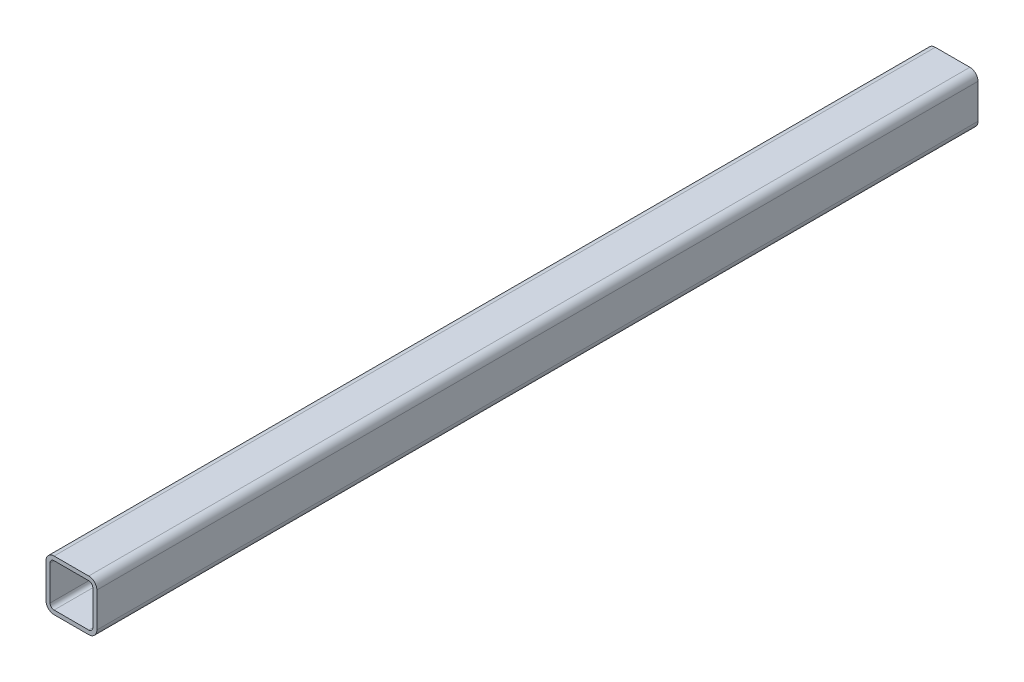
ISO-10303-21;
HEADER;
FILE_DESCRIPTION(('STEP AP214'),'2;1');
FILE_NAME('part.step','',(''),(''),'','','');
FILE_SCHEMA(('AUTOMOTIVE_DESIGN { 1 0 10303 214 1 1 1 1 }'));
ENDSEC;
DATA;
#1=APPLICATION_CONTEXT('core data for automotive mechanical design processes');
#2=APPLICATION_PROTOCOL_DEFINITION('international standard','automotive_design',2000,#1);
#3=PRODUCT_CONTEXT('',#1,'mechanical');
#4=PRODUCT('Part','Part','',(#3));
#5=PRODUCT_RELATED_PRODUCT_CATEGORY('part','',(#4));
#6=PRODUCT_DEFINITION_FORMATION('','',#4);
#7=PRODUCT_DEFINITION_CONTEXT('part definition',#1,'design');
#8=PRODUCT_DEFINITION('design','',#6,#7);
#9=PRODUCT_DEFINITION_SHAPE('','',#8);
#10=(LENGTH_UNIT() NAMED_UNIT(*) SI_UNIT(.MILLI.,.METRE.));
#11=(NAMED_UNIT(*) PLANE_ANGLE_UNIT() SI_UNIT($,.RADIAN.));
#12=(NAMED_UNIT(*) SI_UNIT($,.STERADIAN.) SOLID_ANGLE_UNIT());
#13=UNCERTAINTY_MEASURE_WITH_UNIT(LENGTH_MEASURE(1.E-05),#10,'distance_accuracy_value','');
#14=(GEOMETRIC_REPRESENTATION_CONTEXT(3) GLOBAL_UNCERTAINTY_ASSIGNED_CONTEXT((#13)) GLOBAL_UNIT_ASSIGNED_CONTEXT((#10,
#11,#12)) REPRESENTATION_CONTEXT('',''));
#15=CARTESIAN_POINT('',(0.,0.,0.));
#16=DIRECTION('',(0.,0.,1.));
#17=DIRECTION('',(1.,0.,0.));
#18=AXIS2_PLACEMENT_3D('',#15,#16,#17);
#19=CARTESIAN_POINT('',(-12.97432,12.97432,330.2));
#20=DIRECTION('',(0.,0.,1.));
#21=DIRECTION('',(1.,0.,0.));
#22=AXIS2_PLACEMENT_3D('',#19,#20,#21);
#23=PLANE('',#22);
#24=CARTESIAN_POINT('',(-12.97432,12.97432,330.2));
#25=DIRECTION('',(0.,0.,1.));
#26=DIRECTION('',(-1.,0.,0.));
#27=AXIS2_PLACEMENT_3D('',#24,#25,#26);
#28=CIRCLE('',#27,6.07568);
#29=CARTESIAN_POINT('',(-12.97432,19.05,330.2));
#30=VERTEX_POINT('',#29);
#31=CARTESIAN_POINT('',(-19.05,12.97432,330.2));
#32=VERTEX_POINT('',#31);
#33=EDGE_CURVE('E260',#30,#32,#28,.T.);
#34=ORIENTED_EDGE('',*,*,#33,.T.);
#35=DIRECTION('',(0.,-1.,0.));
#36=VECTOR('',#35,1.);
#37=CARTESIAN_POINT('',(-19.05,12.97432,330.2));
#38=LINE('',#37,#36);
#39=CARTESIAN_POINT('',(-19.05,-12.97432,330.2));
#40=VERTEX_POINT('',#39);
#41=EDGE_CURVE('E263',#32,#40,#38,.T.);
#42=ORIENTED_EDGE('',*,*,#41,.T.);
#43=CARTESIAN_POINT('',(-12.97432,-12.97432,330.2));
#44=DIRECTION('',(0.,0.,1.));
#45=DIRECTION('',(-1.,0.,0.));
#46=AXIS2_PLACEMENT_3D('',#43,#44,#45);
#47=CIRCLE('',#46,6.07568);
#48=CARTESIAN_POINT('',(-12.97432,-19.05,330.2));
#49=VERTEX_POINT('',#48);
#50=EDGE_CURVE('E266',#40,#49,#47,.T.);
#51=ORIENTED_EDGE('',*,*,#50,.T.);
#52=DIRECTION('',(1.,0.,0.));
#53=VECTOR('',#52,1.);
#54=CARTESIAN_POINT('',(-12.97432,-19.05,330.2));
#55=LINE('',#54,#53);
#56=CARTESIAN_POINT('',(12.97432,-19.05,330.2));
#57=VERTEX_POINT('',#56);
#58=EDGE_CURVE('E268',#49,#57,#55,.T.);
#59=ORIENTED_EDGE('',*,*,#58,.T.);
#60=CARTESIAN_POINT('',(12.97432,-12.97432,330.2));
#61=DIRECTION('',(0.,0.,1.));
#62=DIRECTION('',(1.,0.,0.));
#63=AXIS2_PLACEMENT_3D('',#60,#61,#62);
#64=CIRCLE('',#63,6.07568);
#65=CARTESIAN_POINT('',(19.05,-12.97432,330.2));
#66=VERTEX_POINT('',#65);
#67=EDGE_CURVE('E270',#57,#66,#64,.T.);
#68=ORIENTED_EDGE('',*,*,#67,.T.);
#69=DIRECTION('',(0.,1.,0.));
#70=VECTOR('',#69,1.);
#71=CARTESIAN_POINT('',(19.05,12.97432,330.2));
#72=LINE('',#71,#70);
#73=CARTESIAN_POINT('',(19.05,12.97432,330.2));
#74=VERTEX_POINT('',#73);
#75=EDGE_CURVE('E272',#66,#74,#72,.T.);
#76=ORIENTED_EDGE('',*,*,#75,.T.);
#77=CARTESIAN_POINT('',(12.97432,12.97432,330.2));
#78=DIRECTION('',(0.,0.,1.));
#79=DIRECTION('',(1.,0.,0.));
#80=AXIS2_PLACEMENT_3D('',#77,#78,#79);
#81=CIRCLE('',#80,6.07568);
#82=CARTESIAN_POINT('',(12.97432,19.05,330.2));
#83=VERTEX_POINT('',#82);
#84=EDGE_CURVE('E274',#74,#83,#81,.T.);
#85=ORIENTED_EDGE('',*,*,#84,.T.);
#86=DIRECTION('',(-1.,0.,0.));
#87=VECTOR('',#86,1.);
#88=CARTESIAN_POINT('',(-12.97432,19.05,330.2));
#89=LINE('',#88,#87);
#90=EDGE_CURVE('E276',#83,#30,#89,.T.);
#91=ORIENTED_EDGE('',*,*,#90,.T.);
#92=EDGE_LOOP('',(#34,#42,#51,#59,#68,#76,#85,#91));
#93=FACE_BOUND('',#92,.T.);
#94=DIRECTION('',(0.,-1.,0.));
#95=VECTOR('',#94,1.);
#96=CARTESIAN_POINT('',(-16.01216,12.97432,330.2));
#97=LINE('',#96,#95);
#98=CARTESIAN_POINT('',(-16.01216,12.97432,330.2));
#99=VERTEX_POINT('',#98);
#100=CARTESIAN_POINT('',(-16.01216,-12.97432,330.2));
#101=VERTEX_POINT('',#100);
#102=EDGE_CURVE('E203',#99,#101,#97,.T.);
#103=ORIENTED_EDGE('',*,*,#102,.F.);
#104=CARTESIAN_POINT('',(-12.97432,12.97432,330.2));
#105=DIRECTION('',(0.,0.,-1.));
#106=DIRECTION('',(-1.,0.,0.));
#107=AXIS2_PLACEMENT_3D('',#104,#105,#106);
#108=CIRCLE('',#107,3.03784);
#109=CARTESIAN_POINT('',(-12.97432,16.01216,330.2));
#110=VERTEX_POINT('',#109);
#111=EDGE_CURVE('E195',#110,#99,#108,.F.);
#112=ORIENTED_EDGE('',*,*,#111,.F.);
#113=DIRECTION('',(-1.,0.,0.));
#114=VECTOR('',#113,1.);
#115=CARTESIAN_POINT('',(-12.97432,16.01216,330.2));
#116=LINE('',#115,#114);
#117=CARTESIAN_POINT('',(12.97432,16.01216,330.2));
#118=VERTEX_POINT('',#117);
#119=EDGE_CURVE('E228',#118,#110,#116,.T.);
#120=ORIENTED_EDGE('',*,*,#119,.F.);
#121=CARTESIAN_POINT('',(12.97432,12.97432,330.2));
#122=DIRECTION('',(0.,0.,-1.));
#123=DIRECTION('',(-1.,0.,0.));
#124=AXIS2_PLACEMENT_3D('',#121,#122,#123);
#125=CIRCLE('',#124,3.03784);
#126=CARTESIAN_POINT('',(16.01216,12.97432,330.2));
#127=VERTEX_POINT('',#126);
#128=EDGE_CURVE('E226',#127,#118,#125,.F.);
#129=ORIENTED_EDGE('',*,*,#128,.F.);
#130=DIRECTION('',(0.,1.,0.));
#131=VECTOR('',#130,1.);
#132=CARTESIAN_POINT('',(16.01216,12.97432,330.2));
#133=LINE('',#132,#131);
#134=CARTESIAN_POINT('',(16.01216,-12.97432,330.2));
#135=VERTEX_POINT('',#134);
#136=EDGE_CURVE('E224',#135,#127,#133,.T.);
#137=ORIENTED_EDGE('',*,*,#136,.F.);
#138=CARTESIAN_POINT('',(12.97432,-12.97432,330.2));
#139=DIRECTION('',(0.,0.,-1.));
#140=DIRECTION('',(-1.,0.,0.));
#141=AXIS2_PLACEMENT_3D('',#138,#139,#140);
#142=CIRCLE('',#141,3.03784);
#143=CARTESIAN_POINT('',(12.97432,-16.01216,330.2));
#144=VERTEX_POINT('',#143);
#145=EDGE_CURVE('E222',#144,#135,#142,.F.);
#146=ORIENTED_EDGE('',*,*,#145,.F.);
#147=DIRECTION('',(1.,0.,0.));
#148=VECTOR('',#147,1.);
#149=CARTESIAN_POINT('',(-12.97432,-16.01216,330.2));
#150=LINE('',#149,#148);
#151=CARTESIAN_POINT('',(-12.97432,-16.01216,330.2));
#152=VERTEX_POINT('',#151);
#153=EDGE_CURVE('E218',#152,#144,#150,.T.);
#154=ORIENTED_EDGE('',*,*,#153,.F.);
#155=CARTESIAN_POINT('',(-12.97432,-12.97432,330.2));
#156=DIRECTION('',(0.,0.,-1.));
#157=DIRECTION('',(-1.,0.,0.));
#158=AXIS2_PLACEMENT_3D('',#155,#156,#157);
#159=CIRCLE('',#158,3.03784);
#160=EDGE_CURVE('E216',#101,#152,#159,.F.);
#161=ORIENTED_EDGE('',*,*,#160,.F.);
#162=EDGE_LOOP('',(#103,#112,#120,#129,#137,#146,#154,#161));
#163=FACE_BOUND('',#162,.T.);
#164=ADVANCED_FACE('F82',(#93,#163),#23,.T.);
#165=CARTESIAN_POINT('',(-12.97432,12.97432,-330.2));
#166=DIRECTION('',(0.,0.,1.));
#167=DIRECTION('',(1.,0.,0.));
#168=AXIS2_PLACEMENT_3D('',#165,#166,#167);
#169=PLANE('',#168);
#170=CARTESIAN_POINT('',(-12.97432,12.97432,-330.2));
#171=DIRECTION('',(0.,0.,1.));
#172=DIRECTION('',(-1.,0.,0.));
#173=AXIS2_PLACEMENT_3D('',#170,#171,#172);
#174=CIRCLE('',#173,6.07568);
#175=CARTESIAN_POINT('',(-12.97432,19.05,-330.2));
#176=VERTEX_POINT('',#175);
#177=CARTESIAN_POINT('',(-19.05,12.97432,-330.2));
#178=VERTEX_POINT('',#177);
#179=EDGE_CURVE('E211',#176,#178,#174,.T.);
#180=ORIENTED_EDGE('',*,*,#179,.F.);
#181=DIRECTION('',(-1.,0.,0.));
#182=VECTOR('',#181,1.);
#183=CARTESIAN_POINT('',(-12.97432,19.05,-330.2));
#184=LINE('',#183,#182);
#185=CARTESIAN_POINT('',(12.97432,19.05,-330.2));
#186=VERTEX_POINT('',#185);
#187=EDGE_CURVE('E264',#186,#176,#184,.T.);
#188=ORIENTED_EDGE('',*,*,#187,.F.);
#189=CARTESIAN_POINT('',(12.97432,12.97432,-330.2));
#190=DIRECTION('',(0.,0.,1.));
#191=DIRECTION('',(1.,0.,0.));
#192=AXIS2_PLACEMENT_3D('',#189,#190,#191);
#193=CIRCLE('',#192,6.07568);
#194=CARTESIAN_POINT('',(19.05,12.97432,-330.2));
#195=VERTEX_POINT('',#194);
#196=EDGE_CURVE('E291',#195,#186,#193,.T.);
#197=ORIENTED_EDGE('',*,*,#196,.F.);
#198=DIRECTION('',(0.,1.,0.));
#199=VECTOR('',#198,1.);
#200=CARTESIAN_POINT('',(19.05,12.97432,-330.2));
#201=LINE('',#200,#199);
#202=CARTESIAN_POINT('',(19.05,-12.97432,-330.2));
#203=VERTEX_POINT('',#202);
#204=EDGE_CURVE('E289',#203,#195,#201,.T.);
#205=ORIENTED_EDGE('',*,*,#204,.F.);
#206=CARTESIAN_POINT('',(12.97432,-12.97432,-330.2));
#207=DIRECTION('',(0.,0.,1.));
#208=DIRECTION('',(1.,0.,0.));
#209=AXIS2_PLACEMENT_3D('',#206,#207,#208);
#210=CIRCLE('',#209,6.07568);
#211=CARTESIAN_POINT('',(12.97432,-19.05,-330.2));
#212=VERTEX_POINT('',#211);
#213=EDGE_CURVE('E287',#212,#203,#210,.T.);
#214=ORIENTED_EDGE('',*,*,#213,.F.);
#215=DIRECTION('',(1.,0.,0.));
#216=VECTOR('',#215,1.);
#217=CARTESIAN_POINT('',(-12.97432,-19.05,-330.2));
#218=LINE('',#217,#216);
#219=CARTESIAN_POINT('',(-12.97432,-19.05,-330.2));
#220=VERTEX_POINT('',#219);
#221=EDGE_CURVE('E285',#220,#212,#218,.T.);
#222=ORIENTED_EDGE('',*,*,#221,.F.);
#223=CARTESIAN_POINT('',(-12.97432,-12.97432,-330.2));
#224=DIRECTION('',(0.,0.,1.));
#225=DIRECTION('',(-1.,0.,0.));
#226=AXIS2_PLACEMENT_3D('',#223,#224,#225);
#227=CIRCLE('',#226,6.07568);
#228=CARTESIAN_POINT('',(-19.05,-12.97432,-330.2));
#229=VERTEX_POINT('',#228);
#230=EDGE_CURVE('E283',#229,#220,#227,.T.);
#231=ORIENTED_EDGE('',*,*,#230,.F.);
#232=DIRECTION('',(0.,-1.,0.));
#233=VECTOR('',#232,1.);
#234=CARTESIAN_POINT('',(-19.05,12.97432,-330.2));
#235=LINE('',#234,#233);
#236=EDGE_CURVE('E281',#178,#229,#235,.T.);
#237=ORIENTED_EDGE('',*,*,#236,.F.);
#238=EDGE_LOOP('',(#180,#188,#197,#205,#214,#222,#231,#237));
#239=FACE_BOUND('',#238,.T.);
#240=CARTESIAN_POINT('',(-12.97432,12.97432,-330.2));
#241=DIRECTION('',(0.,0.,-1.));
#242=DIRECTION('',(-1.,0.,0.));
#243=AXIS2_PLACEMENT_3D('',#240,#241,#242);
#244=CIRCLE('',#243,3.03784);
#245=CARTESIAN_POINT('',(-12.97432,16.01216,-330.2));
#246=VERTEX_POINT('',#245);
#247=CARTESIAN_POINT('',(-16.01216,12.97432,-330.2));
#248=VERTEX_POINT('',#247);
#249=EDGE_CURVE('E105',#246,#248,#244,.F.);
#250=ORIENTED_EDGE('',*,*,#249,.T.);
#251=DIRECTION('',(0.,-1.,0.));
#252=VECTOR('',#251,1.);
#253=CARTESIAN_POINT('',(-16.01216,12.97432,-330.2));
#254=LINE('',#253,#252);
#255=CARTESIAN_POINT('',(-16.01216,-12.97432,-330.2));
#256=VERTEX_POINT('',#255);
#257=EDGE_CURVE('E210',#248,#256,#254,.T.);
#258=ORIENTED_EDGE('',*,*,#257,.T.);
#259=CARTESIAN_POINT('',(-12.97432,-12.97432,-330.2));
#260=DIRECTION('',(0.,0.,-1.));
#261=DIRECTION('',(-1.,0.,0.));
#262=AXIS2_PLACEMENT_3D('',#259,#260,#261);
#263=CIRCLE('',#262,3.03784);
#264=CARTESIAN_POINT('',(-12.97432,-16.01216,-330.2));
#265=VERTEX_POINT('',#264);
#266=EDGE_CURVE('E232',#256,#265,#263,.F.);
#267=ORIENTED_EDGE('',*,*,#266,.T.);
#268=DIRECTION('',(1.,0.,0.));
#269=VECTOR('',#268,1.);
#270=CARTESIAN_POINT('',(-12.97432,-16.01216,-330.2));
#271=LINE('',#270,#269);
#272=CARTESIAN_POINT('',(12.97432,-16.01216,-330.2));
#273=VERTEX_POINT('',#272);
#274=EDGE_CURVE('E235',#265,#273,#271,.T.);
#275=ORIENTED_EDGE('',*,*,#274,.T.);
#276=CARTESIAN_POINT('',(12.97432,-12.97432,-330.2));
#277=DIRECTION('',(0.,0.,-1.));
#278=DIRECTION('',(-1.,0.,0.));
#279=AXIS2_PLACEMENT_3D('',#276,#277,#278);
#280=CIRCLE('',#279,3.03784);
#281=CARTESIAN_POINT('',(16.01216,-12.97432,-330.2));
#282=VERTEX_POINT('',#281);
#283=EDGE_CURVE('E238',#273,#282,#280,.F.);
#284=ORIENTED_EDGE('',*,*,#283,.T.);
#285=DIRECTION('',(0.,1.,0.));
#286=VECTOR('',#285,1.);
#287=CARTESIAN_POINT('',(16.01216,12.97432,-330.2));
#288=LINE('',#287,#286);
#289=CARTESIAN_POINT('',(16.01216,12.97432,-330.2));
#290=VERTEX_POINT('',#289);
#291=EDGE_CURVE('E241',#282,#290,#288,.T.);
#292=ORIENTED_EDGE('',*,*,#291,.T.);
#293=CARTESIAN_POINT('',(12.97432,12.97432,-330.2));
#294=DIRECTION('',(0.,0.,-1.));
#295=DIRECTION('',(-1.,0.,0.));
#296=AXIS2_PLACEMENT_3D('',#293,#294,#295);
#297=CIRCLE('',#296,3.03784);
#298=CARTESIAN_POINT('',(12.97432,16.01216,-330.2));
#299=VERTEX_POINT('',#298);
#300=EDGE_CURVE('E244',#290,#299,#297,.F.);
#301=ORIENTED_EDGE('',*,*,#300,.T.);
#302=DIRECTION('',(-1.,0.,0.));
#303=VECTOR('',#302,1.);
#304=CARTESIAN_POINT('',(-12.97432,16.01216,-330.2));
#305=LINE('',#304,#303);
#306=EDGE_CURVE('E204',#299,#246,#305,.T.);
#307=ORIENTED_EDGE('',*,*,#306,.T.);
#308=EDGE_LOOP('',(#250,#258,#267,#275,#284,#292,#301,#307));
#309=FACE_BOUND('',#308,.T.);
#310=ADVANCED_FACE('F321',(#239,#309),#169,.F.);
#311=CARTESIAN_POINT('',(-12.97432,12.97432,330.2));
#312=DIRECTION('',(0.,0.,-1.));
#313=DIRECTION('',(-1.,0.,0.));
#314=AXIS2_PLACEMENT_3D('',#311,#312,#313);
#315=CYLINDRICAL_SURFACE('',#314,6.07568);
#316=ORIENTED_EDGE('',*,*,#179,.T.);
#317=DIRECTION('',(0.,0.,-1.));
#318=VECTOR('',#317,1.);
#319=CARTESIAN_POINT('',(-19.05,12.97432,330.2));
#320=LINE('',#319,#318);
#321=EDGE_CURVE('E12',#32,#178,#320,.T.);
#322=ORIENTED_EDGE('',*,*,#321,.F.);
#323=ORIENTED_EDGE('',*,*,#33,.F.);
#324=DIRECTION('',(0.,0.,-1.));
#325=VECTOR('',#324,1.);
#326=CARTESIAN_POINT('',(-12.97432,19.05,330.2));
#327=LINE('',#326,#325);
#328=EDGE_CURVE('E278',#30,#176,#327,.T.);
#329=ORIENTED_EDGE('',*,*,#328,.T.);
#330=EDGE_LOOP('',(#316,#322,#323,#329));
#331=FACE_BOUND('',#330,.T.);
#332=ADVANCED_FACE('F84',(#331),#315,.T.);
#333=CARTESIAN_POINT('',(-19.05,12.97432,330.2));
#334=DIRECTION('',(1.,0.,0.));
#335=DIRECTION('',(0.,1.,0.));
#336=AXIS2_PLACEMENT_3D('',#333,#334,#335);
#337=PLANE('',#336);
#338=ORIENTED_EDGE('',*,*,#236,.T.);
#339=DIRECTION('',(0.,0.,-1.));
#340=VECTOR('',#339,1.);
#341=CARTESIAN_POINT('',(-19.05,-12.97432,330.2));
#342=LINE('',#341,#340);
#343=EDGE_CURVE('E90',#40,#229,#342,.T.);
#344=ORIENTED_EDGE('',*,*,#343,.F.);
#345=ORIENTED_EDGE('',*,*,#41,.F.);
#346=ORIENTED_EDGE('',*,*,#321,.T.);
#347=EDGE_LOOP('',(#338,#344,#345,#346));
#348=FACE_BOUND('',#347,.T.);
#349=ADVANCED_FACE('F338',(#348),#337,.F.);
#350=CARTESIAN_POINT('',(-12.97432,-12.97432,330.2));
#351=DIRECTION('',(0.,0.,-1.));
#352=DIRECTION('',(-1.,0.,0.));
#353=AXIS2_PLACEMENT_3D('',#350,#351,#352);
#354=CYLINDRICAL_SURFACE('',#353,6.07568);
#355=ORIENTED_EDGE('',*,*,#230,.T.);
#356=DIRECTION('',(0.,0.,-1.));
#357=VECTOR('',#356,1.);
#358=CARTESIAN_POINT('',(-12.97432,-19.05,330.2));
#359=LINE('',#358,#357);
#360=EDGE_CURVE('E308',#49,#220,#359,.T.);
#361=ORIENTED_EDGE('',*,*,#360,.F.);
#362=ORIENTED_EDGE('',*,*,#50,.F.);
#363=ORIENTED_EDGE('',*,*,#343,.T.);
#364=EDGE_LOOP('',(#355,#361,#362,#363));
#365=FACE_BOUND('',#364,.T.);
#366=ADVANCED_FACE('F315',(#365),#354,.T.);
#367=CARTESIAN_POINT('',(-12.97432,-19.05,330.2));
#368=DIRECTION('',(0.,1.,0.));
#369=DIRECTION('',(0.,0.,1.));
#370=AXIS2_PLACEMENT_3D('',#367,#368,#369);
#371=PLANE('',#370);
#372=ORIENTED_EDGE('',*,*,#221,.T.);
#373=DIRECTION('',(0.,0.,-1.));
#374=VECTOR('',#373,1.);
#375=CARTESIAN_POINT('',(12.97432,-19.05,330.2));
#376=LINE('',#375,#374);
#377=EDGE_CURVE('E305',#57,#212,#376,.T.);
#378=ORIENTED_EDGE('',*,*,#377,.F.);
#379=ORIENTED_EDGE('',*,*,#58,.F.);
#380=ORIENTED_EDGE('',*,*,#360,.T.);
#381=EDGE_LOOP('',(#372,#378,#379,#380));
#382=FACE_BOUND('',#381,.T.);
#383=ADVANCED_FACE('F327',(#382),#371,.F.);
#384=CARTESIAN_POINT('',(12.97432,-12.97432,330.2));
#385=DIRECTION('',(0.,0.,-1.));
#386=DIRECTION('',(-1.,0.,0.));
#387=AXIS2_PLACEMENT_3D('',#384,#385,#386);
#388=CYLINDRICAL_SURFACE('',#387,6.07568);
#389=ORIENTED_EDGE('',*,*,#213,.T.);
#390=DIRECTION('',(0.,0.,-1.));
#391=VECTOR('',#390,1.);
#392=CARTESIAN_POINT('',(19.05,-12.97432,330.2));
#393=LINE('',#392,#391);
#394=EDGE_CURVE('E302',#66,#203,#393,.T.);
#395=ORIENTED_EDGE('',*,*,#394,.F.);
#396=ORIENTED_EDGE('',*,*,#67,.F.);
#397=ORIENTED_EDGE('',*,*,#377,.T.);
#398=EDGE_LOOP('',(#389,#395,#396,#397));
#399=FACE_BOUND('',#398,.T.);
#400=ADVANCED_FACE('F331',(#399),#388,.T.);
#401=CARTESIAN_POINT('',(19.05,12.97432,330.2));
#402=DIRECTION('',(-1.,0.,0.));
#403=DIRECTION('',(0.,0.,1.));
#404=AXIS2_PLACEMENT_3D('',#401,#402,#403);
#405=PLANE('',#404);
#406=ORIENTED_EDGE('',*,*,#204,.T.);
#407=DIRECTION('',(0.,0.,-1.));
#408=VECTOR('',#407,1.);
#409=CARTESIAN_POINT('',(19.05,12.97432,330.2));
#410=LINE('',#409,#408);
#411=EDGE_CURVE('E299',#74,#195,#410,.T.);
#412=ORIENTED_EDGE('',*,*,#411,.F.);
#413=ORIENTED_EDGE('',*,*,#75,.F.);
#414=ORIENTED_EDGE('',*,*,#394,.T.);
#415=EDGE_LOOP('',(#406,#412,#413,#414));
#416=FACE_BOUND('',#415,.T.);
#417=ADVANCED_FACE('F351',(#416),#405,.F.);
#418=CARTESIAN_POINT('',(12.97432,12.97432,330.2));
#419=DIRECTION('',(0.,0.,-1.));
#420=DIRECTION('',(-1.,0.,0.));
#421=AXIS2_PLACEMENT_3D('',#418,#419,#420);
#422=CYLINDRICAL_SURFACE('',#421,6.07568);
#423=ORIENTED_EDGE('',*,*,#196,.T.);
#424=DIRECTION('',(0.,0.,-1.));
#425=VECTOR('',#424,1.);
#426=CARTESIAN_POINT('',(12.97432,19.05,330.2));
#427=LINE('',#426,#425);
#428=EDGE_CURVE('E296',#83,#186,#427,.T.);
#429=ORIENTED_EDGE('',*,*,#428,.F.);
#430=ORIENTED_EDGE('',*,*,#84,.F.);
#431=ORIENTED_EDGE('',*,*,#411,.T.);
#432=EDGE_LOOP('',(#423,#429,#430,#431));
#433=FACE_BOUND('',#432,.T.);
#434=ADVANCED_FACE('F349',(#433),#422,.T.);
#435=CARTESIAN_POINT('',(-12.97432,19.05,330.2));
#436=DIRECTION('',(0.,-1.,0.));
#437=DIRECTION('',(0.,0.,-1.));
#438=AXIS2_PLACEMENT_3D('',#435,#436,#437);
#439=PLANE('',#438);
#440=ORIENTED_EDGE('',*,*,#187,.T.);
#441=ORIENTED_EDGE('',*,*,#328,.F.);
#442=ORIENTED_EDGE('',*,*,#90,.F.);
#443=ORIENTED_EDGE('',*,*,#428,.T.);
#444=EDGE_LOOP('',(#440,#441,#442,#443));
#445=FACE_BOUND('',#444,.T.);
#446=ADVANCED_FACE('F344',(#445),#439,.F.);
#447=CARTESIAN_POINT('',(-12.97432,12.97432,330.2));
#448=DIRECTION('',(0.,0.,-1.));
#449=DIRECTION('',(-1.,0.,0.));
#450=AXIS2_PLACEMENT_3D('',#447,#448,#449);
#451=CYLINDRICAL_SURFACE('',#450,3.03784);
#452=ORIENTED_EDGE('',*,*,#249,.F.);
#453=DIRECTION('',(0.,0.,-1.));
#454=VECTOR('',#453,1.);
#455=CARTESIAN_POINT('',(-12.97432,16.01216,330.2));
#456=LINE('',#455,#454);
#457=EDGE_CURVE('E199',#110,#246,#456,.T.);
#458=ORIENTED_EDGE('',*,*,#457,.F.);
#459=ORIENTED_EDGE('',*,*,#111,.T.);
#460=DIRECTION('',(0.,0.,-1.));
#461=VECTOR('',#460,1.);
#462=CARTESIAN_POINT('',(-16.01216,12.97432,330.2));
#463=LINE('',#462,#461);
#464=EDGE_CURVE('E198',#99,#248,#463,.T.);
#465=ORIENTED_EDGE('',*,*,#464,.T.);
#466=EDGE_LOOP('',(#452,#458,#459,#465));
#467=FACE_BOUND('',#466,.T.);
#468=ADVANCED_FACE('F197',(#467),#451,.F.);
#469=CARTESIAN_POINT('',(-16.01216,12.97432,330.2));
#470=DIRECTION('',(1.,0.,0.));
#471=DIRECTION('',(0.,1.,0.));
#472=AXIS2_PLACEMENT_3D('',#469,#470,#471);
#473=PLANE('',#472);
#474=ORIENTED_EDGE('',*,*,#257,.F.);
#475=ORIENTED_EDGE('',*,*,#464,.F.);
#476=ORIENTED_EDGE('',*,*,#102,.T.);
#477=DIRECTION('',(0.,0.,-1.));
#478=VECTOR('',#477,1.);
#479=CARTESIAN_POINT('',(-16.01216,-12.97432,330.2));
#480=LINE('',#479,#478);
#481=EDGE_CURVE('E212',#101,#256,#480,.T.);
#482=ORIENTED_EDGE('',*,*,#481,.T.);
#483=EDGE_LOOP('',(#474,#475,#476,#482));
#484=FACE_BOUND('',#483,.T.);
#485=ADVANCED_FACE('F207',(#484),#473,.T.);
#486=CARTESIAN_POINT('',(-12.97432,-12.97432,330.2));
#487=DIRECTION('',(0.,0.,-1.));
#488=DIRECTION('',(-1.,0.,0.));
#489=AXIS2_PLACEMENT_3D('',#486,#487,#488);
#490=CYLINDRICAL_SURFACE('',#489,3.03784);
#491=ORIENTED_EDGE('',*,*,#266,.F.);
#492=ORIENTED_EDGE('',*,*,#481,.F.);
#493=ORIENTED_EDGE('',*,*,#160,.T.);
#494=DIRECTION('',(0.,0.,-1.));
#495=VECTOR('',#494,1.);
#496=CARTESIAN_POINT('',(-12.97432,-16.01216,330.2));
#497=LINE('',#496,#495);
#498=EDGE_CURVE('E257',#152,#265,#497,.T.);
#499=ORIENTED_EDGE('',*,*,#498,.T.);
#500=EDGE_LOOP('',(#491,#492,#493,#499));
#501=FACE_BOUND('',#500,.T.);
#502=ADVANCED_FACE('F376',(#501),#490,.F.);
#503=CARTESIAN_POINT('',(-12.97432,-16.01216,330.2));
#504=DIRECTION('',(0.,1.,0.));
#505=DIRECTION('',(0.,0.,1.));
#506=AXIS2_PLACEMENT_3D('',#503,#504,#505);
#507=PLANE('',#506);
#508=ORIENTED_EDGE('',*,*,#274,.F.);
#509=ORIENTED_EDGE('',*,*,#498,.F.);
#510=ORIENTED_EDGE('',*,*,#153,.T.);
#511=DIRECTION('',(0.,0.,-1.));
#512=VECTOR('',#511,1.);
#513=CARTESIAN_POINT('',(12.97432,-16.01216,330.2));
#514=LINE('',#513,#512);
#515=EDGE_CURVE('E255',#144,#273,#514,.T.);
#516=ORIENTED_EDGE('',*,*,#515,.T.);
#517=EDGE_LOOP('',(#508,#509,#510,#516));
#518=FACE_BOUND('',#517,.T.);
#519=ADVANCED_FACE('F380',(#518),#507,.T.);
#520=CARTESIAN_POINT('',(12.97432,-12.97432,330.2));
#521=DIRECTION('',(0.,0.,-1.));
#522=DIRECTION('',(-1.,0.,0.));
#523=AXIS2_PLACEMENT_3D('',#520,#521,#522);
#524=CYLINDRICAL_SURFACE('',#523,3.03784);
#525=ORIENTED_EDGE('',*,*,#283,.F.);
#526=ORIENTED_EDGE('',*,*,#515,.F.);
#527=ORIENTED_EDGE('',*,*,#145,.T.);
#528=DIRECTION('',(0.,0.,-1.));
#529=VECTOR('',#528,1.);
#530=CARTESIAN_POINT('',(16.01216,-12.97432,330.2));
#531=LINE('',#530,#529);
#532=EDGE_CURVE('E253',#135,#282,#531,.T.);
#533=ORIENTED_EDGE('',*,*,#532,.T.);
#534=EDGE_LOOP('',(#525,#526,#527,#533));
#535=FACE_BOUND('',#534,.T.);
#536=ADVANCED_FACE('F386',(#535),#524,.F.);
#537=CARTESIAN_POINT('',(16.01216,12.97432,330.2));
#538=DIRECTION('',(-1.,0.,0.));
#539=DIRECTION('',(0.,0.,1.));
#540=AXIS2_PLACEMENT_3D('',#537,#538,#539);
#541=PLANE('',#540);
#542=ORIENTED_EDGE('',*,*,#291,.F.);
#543=ORIENTED_EDGE('',*,*,#532,.F.);
#544=ORIENTED_EDGE('',*,*,#136,.T.);
#545=DIRECTION('',(0.,0.,-1.));
#546=VECTOR('',#545,1.);
#547=CARTESIAN_POINT('',(16.01216,12.97432,330.2));
#548=LINE('',#547,#546);
#549=EDGE_CURVE('E251',#127,#290,#548,.T.);
#550=ORIENTED_EDGE('',*,*,#549,.T.);
#551=EDGE_LOOP('',(#542,#543,#544,#550));
#552=FACE_BOUND('',#551,.T.);
#553=ADVANCED_FACE('F390',(#552),#541,.T.);
#554=CARTESIAN_POINT('',(12.97432,12.97432,330.2));
#555=DIRECTION('',(0.,0.,-1.));
#556=DIRECTION('',(-1.,0.,0.));
#557=AXIS2_PLACEMENT_3D('',#554,#555,#556);
#558=CYLINDRICAL_SURFACE('',#557,3.03784);
#559=ORIENTED_EDGE('',*,*,#300,.F.);
#560=ORIENTED_EDGE('',*,*,#549,.F.);
#561=ORIENTED_EDGE('',*,*,#128,.T.);
#562=DIRECTION('',(0.,0.,-1.));
#563=VECTOR('',#562,1.);
#564=CARTESIAN_POINT('',(12.97432,16.01216,330.2));
#565=LINE('',#564,#563);
#566=EDGE_CURVE('E97',#118,#299,#565,.T.);
#567=ORIENTED_EDGE('',*,*,#566,.T.);
#568=EDGE_LOOP('',(#559,#560,#561,#567));
#569=FACE_BOUND('',#568,.T.);
#570=ADVANCED_FACE('F394',(#569),#558,.F.);
#571=CARTESIAN_POINT('',(-12.97432,16.01216,330.2));
#572=DIRECTION('',(0.,-1.,0.));
#573=DIRECTION('',(0.,0.,-1.));
#574=AXIS2_PLACEMENT_3D('',#571,#572,#573);
#575=PLANE('',#574);
#576=ORIENTED_EDGE('',*,*,#306,.F.);
#577=ORIENTED_EDGE('',*,*,#566,.F.);
#578=ORIENTED_EDGE('',*,*,#119,.T.);
#579=ORIENTED_EDGE('',*,*,#457,.T.);
#580=EDGE_LOOP('',(#576,#577,#578,#579));
#581=FACE_BOUND('',#580,.T.);
#582=ADVANCED_FACE('F398',(#581),#575,.T.);
#583=CLOSED_SHELL('',(#164,#310,#332,#349,#366,#383,#400,#417,#434,#446,#468,#485,#502,#519,
#536,#553,#570,#582));
#584=MANIFOLD_SOLID_BREP('B2',#583);
#585=ADVANCED_BREP_SHAPE_REPRESENTATION('',(#18,#584),#14);
#586=SHAPE_DEFINITION_REPRESENTATION(#9,#585);
ENDSEC;
END-ISO-10303-21;
